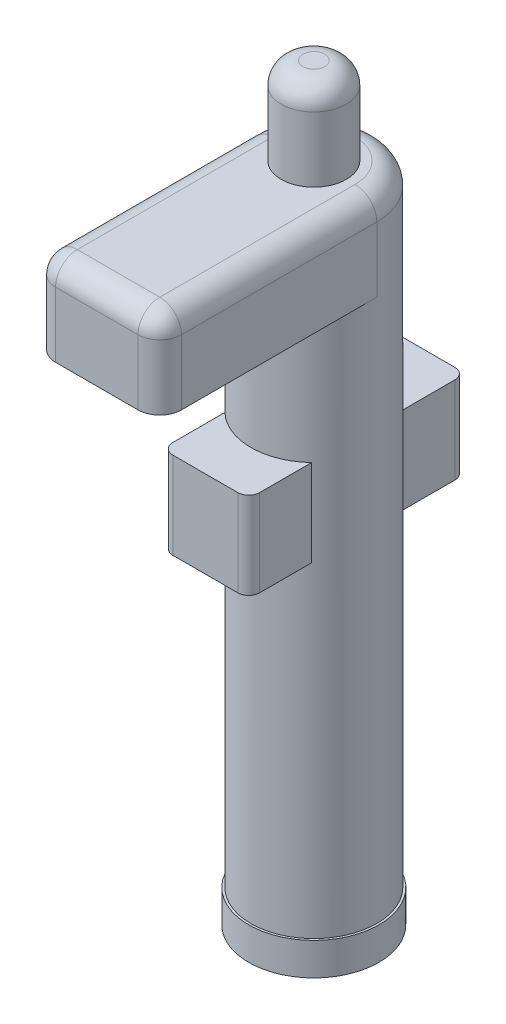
from build123d import *

# Parameters (mm, degrees)
SKETCH2_R                = 2.9
BOSS_EXTRUDE1_DEPTH      = 25
BOSS_EXTRUDE2_DEPTH      = 4
SKETCH5_R                = 2.9
BOSS_EXTRUDE3_DEPTH      = 4
FILLET1_R                = 1
BOSS_EXTRUDE6_DEPTH      = 5
BOSS_EXTRUDE6_DEPTH_BACK = 5
SKETCH6_W                = 4
SKETCH6_H                = 4
FILLET3_R                = 0.5
SKETCH7_R                = 1.5
BOSS_EXTRUDE4_DEPTH      = 4
FILLET2_R                = 1
SKETCH8_R                = 3
BOSS_EXTRUDE5_DEPTH      = 1.5


with BuildPart() as part:
    # Sketch2 → Boss-Extrude1 (new body)
    with BuildSketch(Plane(origin=(0, 0, 0), x_dir=(1, 0, 0), z_dir=(0, 1, 0))):
        with Locations(Location((0, 0, 0), (0, 0, 270))):
            Circle(SKETCH2_R)
    extrude(amount=BOSS_EXTRUDE1_DEPTH)


with BuildPart() as body_2:
    # Sketch4 → Boss-Extrude2 (new body)
    with BuildSketch(Plane(origin=(0, 25, 0), x_dir=(1, 0, 0), z_dir=(0, 1, 0))):
        with BuildLine():
            Line((-2.9, 0), (-2.9, -10))
            Line((-2.9, -10), (2.9, -10))
            Line((2.9, -10), (2.9, 0))
            ThreePointArc((2.9, 0), (0, -2.9), (-2.9, 0))
        make_face()
    extrude(amount=BOSS_EXTRUDE2_DEPTH)


with BuildPart() as boss_extrude3_tool:
    # Sketch5 → Boss-Extrude3 (new body)
    with BuildSketch(Plane(origin=(0, 25, 0), x_dir=(1, 0, 0), z_dir=(0, 1, 0))):
        Circle(SKETCH5_R)
    extrude(amount=BOSS_EXTRUDE3_DEPTH)


with BuildPart() as part_1:
    add(part.part)


with BuildPart() as part_2:
    # Boss-Extrude3: joined with boss_extrude3_tool
    add(part_1.part.fuse(boss_extrude3_tool.part, body_2.part, tol=0.00001))

    # Fillet1
    fillet1_edges = [part_2.edges().sort_by_distance(p)[0] for p in [
        (2.9, 27, 10),
        (-2.9, 27, 10),
        (2.9, 29, 5),
        (-2.9, 29, 5),
        (0, 29, 10),
        (0, 29, -2.9),
    ]]
    fillet(fillet1_edges, radius=FILLET1_R)

    # Sketch6 → Boss-Extrude6 (add, two sides: drawn at the far end of the back side and taken through both)
    with BuildSketch(Plane.XY.offset(-BOSS_EXTRUDE6_DEPTH_BACK)):
        with Locations((0, 17)):
            Rectangle(SKETCH6_W, SKETCH6_H)
    extrude(amount=BOSS_EXTRUDE6_DEPTH + BOSS_EXTRUDE6_DEPTH_BACK)

    # Fillet3
    fillet3_edges = [part_2.edges().sort_by_distance(p)[0] for p in [
        (-2, 17, -5),
        (2, 17, -5),
        (-2, 17, 5),
        (2, 17, 5),
    ]]
    fillet(fillet3_edges, radius=FILLET3_R)

    # Sketch7 → Boss-Extrude4 (add)
    with BuildSketch(Plane(origin=(0, 29, 0), x_dir=(1, 0, 0), z_dir=(0, 1, 0))):
        with Locations(Location((0, 0, 0), (0, 0, 270))):
            Circle(SKETCH7_R)
    extrude(amount=BOSS_EXTRUDE4_DEPTH)

    # Fillet2
    fillet2_edges = [part_2.edges().sort_by_distance(p)[0] for p in [
        (0, 33, -1.5),
    ]]
    fillet(fillet2_edges, radius=FILLET2_R)

    # Sketch8 → Boss-Extrude5 (add)
    with BuildSketch(Plane(origin=(0, 0, 0), x_dir=(-1, 0, 0), z_dir=(0, -1, 0))):
        with Locations(Location((0, 0, 0), (0, 0, 90))):
            Circle(SKETCH8_R)
    extrude(amount=BOSS_EXTRUDE5_DEPTH)


solid = part_2.part
